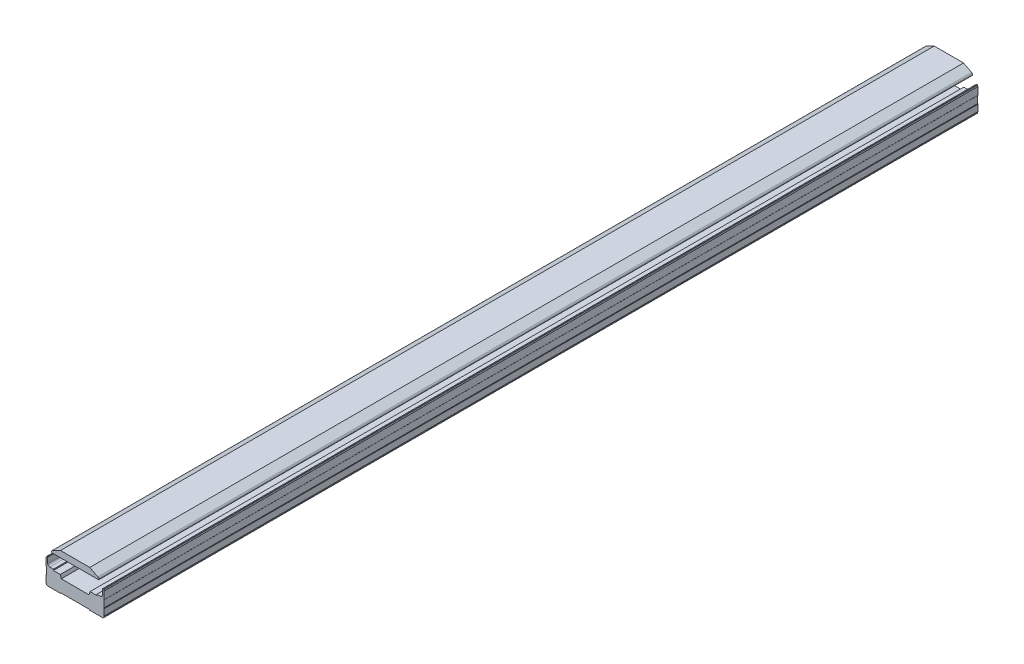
from build123d import *

# Parameters (mm, degrees)
EXTRUDE_1_DEPTH              = 1530
EXTRUDE_1_2_DEPTH            = 1530
HOLE_WIZARD_1_AT_2_COUNT     = 2
HOLE_WIZARD_1_AT_2_PITCH     = 85
HOLE_WIZARD_1_AT_3_COUNT     = 2
HOLE_WIZARD_1_AT_3_PITCH     = 98.615414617
HOLE_WIZARD_1_AT_4_COUNT     = 2
HOLE_WIZARD_1_AT_4_PITCH     = 50
HOLE_WIZARD_1_AT_5_COUNT     = 2
HOLE_WIZARD_1_AT_5_PITCH     = 264.05491853
HOLE_WIZARD_1_AT_6_COUNT     = 2
HOLE_WIZARD_1_AT_6_PITCH     = 250
HOLE_WIZARD_1_AT_7_COUNT     = 2
HOLE_WIZARD_1_AT_7_PITCH     = 457.957421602
HOLE_WIZARD_1_AT_8_COUNT     = 2
HOLE_WIZARD_1_AT_8_PITCH     = 450
HOLE_WIZARD_1_AT_9_COUNT     = 2
HOLE_WIZARD_1_AT_9_PITCH     = 655.53413336
HOLE_WIZARD_1_AT_10_COUNT    = 2
HOLE_WIZARD_1_AT_10_PITCH    = 650
HOLE_WIZARD_1_AT_11_COUNT    = 2
HOLE_WIZARD_1_AT_11_PITCH    = 854.239427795
HOLE_WIZARD_1_AT_12_COUNT    = 2
HOLE_WIZARD_1_AT_12_PITCH    = 850
HOLE_WIZARD_1_AT_13_COUNT    = 2
HOLE_WIZARD_1_AT_13_PITCH    = 1050
HOLE_WIZARD_1_AT_14_COUNT    = 2
HOLE_WIZARD_1_AT_14_PITCH    = 1053.434857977
HOLE_WIZARD_1_AT_15_COUNT    = 2
HOLE_WIZARD_1_AT_15_PITCH    = 1250
HOLE_WIZARD_1_AT_16_COUNT    = 2
HOLE_WIZARD_1_AT_16_PITCH    = 1450
HOLE_WIZARD_1_AT_17_COUNT    = 2
HOLE_WIZARD_1_AT_17_PITCH    = 1452.489242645
HOLE_WIZARD_1_AT_18_COUNT    = 2
HOLE_WIZARD_1_AT_18_PITCH    = 1252.886666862
HOLE_WIZARD_M5_1_AT_2_COUNT  = 2
HOLE_WIZARD_M5_1_AT_2_PITCH  = 85
HOLE_WIZARD_M5_1_AT_3_COUNT  = 2
HOLE_WIZARD_M5_1_AT_3_PITCH  = 50
HOLE_WIZARD_M5_1_AT_4_COUNT  = 2
HOLE_WIZARD_M5_1_AT_4_PITCH  = 98.615414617
HOLE_WIZARD_M5_1_AT_5_COUNT  = 2
HOLE_WIZARD_M5_1_AT_5_PITCH  = 264.05491853
HOLE_WIZARD_M5_1_AT_6_COUNT  = 2
HOLE_WIZARD_M5_1_AT_6_PITCH  = 250
HOLE_WIZARD_M5_1_AT_7_COUNT  = 2
HOLE_WIZARD_M5_1_AT_7_PITCH  = 457.957421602
HOLE_WIZARD_M5_1_AT_8_COUNT  = 2
HOLE_WIZARD_M5_1_AT_8_PITCH  = 450
HOLE_WIZARD_M5_1_AT_9_COUNT  = 2
HOLE_WIZARD_M5_1_AT_9_PITCH  = 655.53413336
HOLE_WIZARD_M5_1_AT_10_COUNT = 2
HOLE_WIZARD_M5_1_AT_10_PITCH = 650
HOLE_WIZARD_M5_1_AT_11_COUNT = 2
HOLE_WIZARD_M5_1_AT_11_PITCH = 854.239427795
HOLE_WIZARD_M5_1_AT_12_COUNT = 2
HOLE_WIZARD_M5_1_AT_12_PITCH = 850
HOLE_WIZARD_M5_1_AT_13_COUNT = 2
HOLE_WIZARD_M5_1_AT_13_PITCH = 1050
HOLE_WIZARD_M5_1_AT_14_COUNT = 2
HOLE_WIZARD_M5_1_AT_14_PITCH = 1053.434857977
HOLE_WIZARD_M5_1_AT_15_COUNT = 2
HOLE_WIZARD_M5_1_AT_15_PITCH = 1250
HOLE_WIZARD_M5_1_AT_16_COUNT = 2
HOLE_WIZARD_M5_1_AT_16_PITCH = 1450
HOLE_WIZARD_M5_1_AT_17_COUNT = 2
HOLE_WIZARD_M5_1_AT_17_PITCH = 1452.489242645
HOLE_WIZARD_M5_1_AT_18_COUNT = 2
HOLE_WIZARD_M5_1_AT_18_PITCH = 1252.886666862


with BuildPart() as part:
    # Sketch 1 → Extrude 1 (new body)
    with BuildSketch(Plane.XY):
        with BuildLine():
            Line((39.861971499, 56.764617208), (25.661733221, 64))
            Line((25.661733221, 64), (24.553334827, 64))
            Line((24.553334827, 64), (-24.553334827, 64))
            Line((-24.553334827, 64), (-25.661733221, 64))
            Line((-25.661733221, 64), (-39.861971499, 56.764617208))
            ThreePointArc((-39.861971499, 56.764617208), (-41.057920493, 55.65909333), (-41.5, 54.091597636))
            Line((-41.5, 54.091597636), (-41.5, 53.4))
            ThreePointArc((-41.5, 53.4), (-41.382842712, 53.117157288), (-41.1, 53))
            Line((-41.1, 53), (41.1, 53))
            ThreePointArc((41.1, 53), (41.382842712, 53.117157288), (41.5, 53.4))
            Line((41.5, 53.4), (41.5, 54.091597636))
            ThreePointArc((41.5, 54.091597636), (41.057920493, 55.65909333), (39.861971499, 56.764617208))
        make_face()
    extrude(amount=-EXTRUDE_1_DEPTH)


with BuildPart() as body_2:
    # Sketch 1 → Extrude 1 2 (new body)
    with BuildSketch(Plane.XY):
        with BuildLine():
            Line((-24.5, 0), (24.5, 0))
            Line((24.5, 0), (25.5, -1))
            Line((25.5, -1), (49, -1))
            ThreePointArc((49, -1), (49.692161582, -0.339351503), (50.141102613, 0.505631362))
            Line((50.141102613, 0.505631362), (50.999993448, 3.000004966))
            Line((50.999993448, 3.000004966), (50.999993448, 14.133979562))
            ThreePointArc((50.999993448, 14.133979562), (50.93300615, 14.383979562), (50.749993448, 14.566992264))
            ThreePointArc((50.749993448, 14.566992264), (50.566980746, 14.750004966), (50.499993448, 15.000004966))
            Line((50.499993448, 15.000004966), (50.499993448, 27.000004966))
            ThreePointArc((50.499993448, 27.000004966), (50.566980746, 27.250004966), (50.749993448, 27.433017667))
            ThreePointArc((50.749993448, 27.433017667), (50.93300615, 27.616030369), (50.999993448, 27.866030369))
            Line((50.999993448, 27.866030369), (50.999993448, 40.881970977))
            ThreePointArc((50.999993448, 40.881970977), (50.988353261, 40.989556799), (50.953817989, 41.09211175))
            Line((50.953817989, 41.09211175), (50.138190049, 42.723611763))
            ThreePointArc((50.138190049, 42.723611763), (49.95384201, 42.92533037), (49.690976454, 43.000004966))
            Line((49.690976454, 43.000004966), (48.299993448, 43.000004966))
            ThreePointArc((48.299993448, 43.000004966), (48.087861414, 42.912137), (47.999993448, 42.700004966))
            Line((47.999993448, 42.700004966), (47.999993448, 33.000004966))
            ThreePointArc((47.999993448, 33.000004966), (46.974867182, 30.525131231), (44.499993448, 29.500004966))
            Line((44.499993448, 29.500004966), (38, 29.500004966))
            Line((38, 29.500004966), (38, 27.5))
            Line((38, 27.5), (26, 27.5))
            Line((26, 27.5), (24.196643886, 21.780485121))
            Line((24.196643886, 21.780485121), (-24.196643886, 21.780485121))
            Line((-24.196643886, 21.780485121), (-26, 27.5))
            Line((-26, 27.5), (-38, 27.5))
            Line((-38, 27.5), (-38, 29.5))
            Line((-38, 29.5), (-44.5, 29.5))
            ThreePointArc((-44.5, 29.5), (-46.974873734, 30.525126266), (-48, 33))
            Line((-48, 33), (-48, 42.7))
            ThreePointArc((-48, 42.7), (-48.087867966, 42.912132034), (-48.3, 43))
            Line((-48.3, 43), (-49.690983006, 43))
            ThreePointArc((-49.690983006, 43), (-49.953848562, 42.925325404), (-50.138196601, 42.723606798))
            Line((-50.138196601, 42.723606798), (-50.953824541, 41.092106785))
            ThreePointArc((-50.953824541, 41.092106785), (-50.988359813, 40.989551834), (-51, 40.881966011))
            Line((-51, 40.881966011), (-51, 27.866025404))
            ThreePointArc((-51, 27.866025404), (-50.933012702, 27.616025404), (-50.75, 27.433012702))
            ThreePointArc((-50.75, 27.433012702), (-50.566987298, 27.25), (-50.5, 27))
            Line((-50.5, 27), (-50.5, 15))
            ThreePointArc((-50.5, 15), (-50.566987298, 14.75), (-50.75, 14.566987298))
            ThreePointArc((-50.75, 14.566987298), (-50.933012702, 14.383974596), (-51, 14.133974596))
            Line((-51, 14.133974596), (-51, 3))
            Line((-51, 3), (-50.141114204, 0.505614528))
            ThreePointArc((-50.141114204, 0.505614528), (-49.692165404, -0.339360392), (-49, -1))
            Line((-49, -1), (-25.5, -1))
            Line((-25.5, -1), (-24.5, 0))
        make_face()
    extrude(amount=-EXTRUDE_1_2_DEPTH)

    # Sketch 4 → Hole Wizard 1 (revolve, cut)
    with BuildSketch(Plane(origin=(-42.5, 43, -1479.5), x_dir=(0, 0, 1), z_dir=(1, 0, 0))):
        Polygon((0, 0), (0, 44), (2.75, 44), (2.75, 30.5), (5, 30.5), (5, 0), align=None)
    hole_wizard_1 = revolve(axis=Axis((-42.5, 49.35, -1479.5), (0, -1, 0)), mode=Mode.SUBTRACT)

    # Hole Wizard 1 at 2: Hole Wizard 1 ×2
    with Locations(*[(i * HOLE_WIZARD_1_AT_2_PITCH, 0, 0) for i in range(1, HOLE_WIZARD_1_AT_2_COUNT)]):
        add(hole_wizard_1, mode=Mode.SUBTRACT)

    # Hole Wizard 1 at 3: Hole Wizard 1 ×2
    with Locations(*[Vector(0.8619342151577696, 0, 0.5070201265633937) * (i * HOLE_WIZARD_1_AT_3_PITCH) for i in range(1, HOLE_WIZARD_1_AT_3_COUNT)]):
        add(hole_wizard_1, mode=Mode.SUBTRACT)

    # Hole Wizard 1 at 4: Hole Wizard 1 ×2
    with Locations(*[(0, 0, i * HOLE_WIZARD_1_AT_4_PITCH) for i in range(1, HOLE_WIZARD_1_AT_4_COUNT)]):
        add(hole_wizard_1, mode=Mode.SUBTRACT)

    # Hole Wizard 1 at 5: Hole Wizard 1 ×2
    with Locations(*[Vector(0.32190273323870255, 0, 0.9467727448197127) * (i * HOLE_WIZARD_1_AT_5_PITCH) for i in range(1, HOLE_WIZARD_1_AT_5_COUNT)]):
        add(hole_wizard_1, mode=Mode.SUBTRACT)

    # Hole Wizard 1 at 6: Hole Wizard 1 ×2
    with Locations(*[(0, 0, i * HOLE_WIZARD_1_AT_6_PITCH) for i in range(1, HOLE_WIZARD_1_AT_6_COUNT)]):
        add(hole_wizard_1, mode=Mode.SUBTRACT)

    # Hole Wizard 1 at 7: Hole Wizard 1 ×2
    with Locations(*[Vector(0.18560677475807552, 0, 0.9826241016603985) * (i * HOLE_WIZARD_1_AT_7_PITCH) for i in range(1, HOLE_WIZARD_1_AT_7_COUNT)]):
        add(hole_wizard_1, mode=Mode.SUBTRACT)

    # Hole Wizard 1 at 8: Hole Wizard 1 ×2
    with Locations(*[(0, 0, i * HOLE_WIZARD_1_AT_8_PITCH) for i in range(1, HOLE_WIZARD_1_AT_8_COUNT)]):
        add(hole_wizard_1, mode=Mode.SUBTRACT)

    # Hole Wizard 1 at 9: Hole Wizard 1 ×2
    with Locations(*[Vector(0.12966525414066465, 0, 0.9915578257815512) * (i * HOLE_WIZARD_1_AT_9_PITCH) for i in range(1, HOLE_WIZARD_1_AT_9_COUNT)]):
        add(hole_wizard_1, mode=Mode.SUBTRACT)

    # Hole Wizard 1 at 10: Hole Wizard 1 ×2
    with Locations(*[(0, 0, i * HOLE_WIZARD_1_AT_10_PITCH) for i in range(1, HOLE_WIZARD_1_AT_10_COUNT)]):
        add(hole_wizard_1, mode=Mode.SUBTRACT)

    # Hole Wizard 1 at 11: Hole Wizard 1 ×2
    with Locations(*[Vector(0.09950371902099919, 0, 0.9950371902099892) * (i * HOLE_WIZARD_1_AT_11_PITCH) for i in range(1, HOLE_WIZARD_1_AT_11_COUNT)]):
        add(hole_wizard_1, mode=Mode.SUBTRACT)

    # Hole Wizard 1 at 12: Hole Wizard 1 ×2
    with Locations(*[(0, 0, i * HOLE_WIZARD_1_AT_12_PITCH) for i in range(1, HOLE_WIZARD_1_AT_12_COUNT)]):
        add(hole_wizard_1, mode=Mode.SUBTRACT)

    # Hole Wizard 1 at 13: Hole Wizard 1 ×2
    with Locations(*[(0, 0, i * HOLE_WIZARD_1_AT_13_PITCH) for i in range(1, HOLE_WIZARD_1_AT_13_COUNT)]):
        add(hole_wizard_1, mode=Mode.SUBTRACT)

    # Hole Wizard 1 at 14: Hole Wizard 1 ×2
    with Locations(*[Vector(0.08068842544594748, 0, 0.9967393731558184) * (i * HOLE_WIZARD_1_AT_14_PITCH) for i in range(1, HOLE_WIZARD_1_AT_14_COUNT)]):
        add(hole_wizard_1, mode=Mode.SUBTRACT)

    # Hole Wizard 1 at 15: Hole Wizard 1 ×2
    with Locations(*[(0, 0, i * HOLE_WIZARD_1_AT_15_PITCH) for i in range(1, HOLE_WIZARD_1_AT_15_COUNT)]):
        add(hole_wizard_1, mode=Mode.SUBTRACT)

    # Hole Wizard 1 at 16: Hole Wizard 1 ×2
    with Locations(*[(0, 0, i * HOLE_WIZARD_1_AT_16_PITCH) for i in range(1, HOLE_WIZARD_1_AT_16_COUNT)]):
        add(hole_wizard_1, mode=Mode.SUBTRACT)

    # Hole Wizard 1 at 17: Hole Wizard 1 ×2
    with Locations(*[Vector(0.05852022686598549, 0, 0.9982862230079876) * (i * HOLE_WIZARD_1_AT_17_PITCH) for i in range(1, HOLE_WIZARD_1_AT_17_COUNT)]):
        add(hole_wizard_1, mode=Mode.SUBTRACT)

    # Hole Wizard 1 at 18: Hole Wizard 1 ×2
    with Locations(*[Vector(0.06784332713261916, 0, 0.9976959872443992) * (i * HOLE_WIZARD_1_AT_18_PITCH) for i in range(1, HOLE_WIZARD_1_AT_18_COUNT)]):
        add(hole_wizard_1, mode=Mode.SUBTRACT)

    # Sketch 6 → Hole Wizard M5 _1 (revolve, cut)
    with BuildSketch(Plane(origin=(-42.5, -1, -1489.5), x_dir=(0, 0, -1), z_dir=(1, 0, 0))):
        Polygon((0, 0), (0, 13.6618073), (2.1, 12.4), (2.1, 0), align=None)
    hole_wizard_m5_1 = revolve(axis=Axis((-42.5, -7.35, -1489.5), (0, 1, 0)), mode=Mode.SUBTRACT)

    # Hole Wizard M5 _1 at 2: Hole Wizard M5 _1 ×2
    with Locations(*[(i * HOLE_WIZARD_M5_1_AT_2_PITCH, 0, 0) for i in range(1, HOLE_WIZARD_M5_1_AT_2_COUNT)]):
        add(hole_wizard_m5_1, mode=Mode.SUBTRACT)

    # Hole Wizard M5 _1 at 3: Hole Wizard M5 _1 ×2
    with Locations(*[(0, 0, i * HOLE_WIZARD_M5_1_AT_3_PITCH) for i in range(1, HOLE_WIZARD_M5_1_AT_3_COUNT)]):
        add(hole_wizard_m5_1, mode=Mode.SUBTRACT)

    # Hole Wizard M5 _1 at 4: Hole Wizard M5 _1 ×2
    with Locations(*[Vector(0.8619342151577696, 0, 0.5070201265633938) * (i * HOLE_WIZARD_M5_1_AT_4_PITCH) for i in range(1, HOLE_WIZARD_M5_1_AT_4_COUNT)]):
        add(hole_wizard_m5_1, mode=Mode.SUBTRACT)

    # Hole Wizard M5 _1 at 5: Hole Wizard M5 _1 ×2
    with Locations(*[Vector(0.3219027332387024, 0, 0.9467727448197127) * (i * HOLE_WIZARD_M5_1_AT_5_PITCH) for i in range(1, HOLE_WIZARD_M5_1_AT_5_COUNT)]):
        add(hole_wizard_m5_1, mode=Mode.SUBTRACT)

    # Hole Wizard M5 _1 at 6: Hole Wizard M5 _1 ×2
    with Locations(*[(0, 0, i * HOLE_WIZARD_M5_1_AT_6_PITCH) for i in range(1, HOLE_WIZARD_M5_1_AT_6_COUNT)]):
        add(hole_wizard_m5_1, mode=Mode.SUBTRACT)

    # Hole Wizard M5 _1 at 7: Hole Wizard M5 _1 ×2
    with Locations(*[Vector(0.18560677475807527, 0, 0.9826241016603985) * (i * HOLE_WIZARD_M5_1_AT_7_PITCH) for i in range(1, HOLE_WIZARD_M5_1_AT_7_COUNT)]):
        add(hole_wizard_m5_1, mode=Mode.SUBTRACT)

    # Hole Wizard M5 _1 at 8: Hole Wizard M5 _1 ×2
    with Locations(*[(0, 0, i * HOLE_WIZARD_M5_1_AT_8_PITCH) for i in range(1, HOLE_WIZARD_M5_1_AT_8_COUNT)]):
        add(hole_wizard_m5_1, mode=Mode.SUBTRACT)

    # Hole Wizard M5 _1 at 9: Hole Wizard M5 _1 ×2
    with Locations(*[Vector(0.1296652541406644, 0, 0.9915578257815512) * (i * HOLE_WIZARD_M5_1_AT_9_PITCH) for i in range(1, HOLE_WIZARD_M5_1_AT_9_COUNT)]):
        add(hole_wizard_m5_1, mode=Mode.SUBTRACT)

    # Hole Wizard M5 _1 at 10: Hole Wizard M5 _1 ×2
    with Locations(*[(0, 0, i * HOLE_WIZARD_M5_1_AT_10_PITCH) for i in range(1, HOLE_WIZARD_M5_1_AT_10_COUNT)]):
        add(hole_wizard_m5_1, mode=Mode.SUBTRACT)

    # Hole Wizard M5 _1 at 11: Hole Wizard M5 _1 ×2
    with Locations(*[Vector(0.09950371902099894, 0, 0.9950371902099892) * (i * HOLE_WIZARD_M5_1_AT_11_PITCH) for i in range(1, HOLE_WIZARD_M5_1_AT_11_COUNT)]):
        add(hole_wizard_m5_1, mode=Mode.SUBTRACT)

    # Hole Wizard M5 _1 at 12: Hole Wizard M5 _1 ×2
    with Locations(*[(0, 0, i * HOLE_WIZARD_M5_1_AT_12_PITCH) for i in range(1, HOLE_WIZARD_M5_1_AT_12_COUNT)]):
        add(hole_wizard_m5_1, mode=Mode.SUBTRACT)

    # Hole Wizard M5 _1 at 13: Hole Wizard M5 _1 ×2
    with Locations(*[(0, 0, i * HOLE_WIZARD_M5_1_AT_13_PITCH) for i in range(1, HOLE_WIZARD_M5_1_AT_13_COUNT)]):
        add(hole_wizard_m5_1, mode=Mode.SUBTRACT)

    # Hole Wizard M5 _1 at 14: Hole Wizard M5 _1 ×2
    with Locations(*[Vector(0.08068842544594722, 0, 0.9967393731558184) * (i * HOLE_WIZARD_M5_1_AT_14_PITCH) for i in range(1, HOLE_WIZARD_M5_1_AT_14_COUNT)]):
        add(hole_wizard_m5_1, mode=Mode.SUBTRACT)

    # Hole Wizard M5 _1 at 15: Hole Wizard M5 _1 ×2
    with Locations(*[(0, 0, i * HOLE_WIZARD_M5_1_AT_15_PITCH) for i in range(1, HOLE_WIZARD_M5_1_AT_15_COUNT)]):
        add(hole_wizard_m5_1, mode=Mode.SUBTRACT)

    # Hole Wizard M5 _1 at 16: Hole Wizard M5 _1 ×2
    with Locations(*[(0, 0, i * HOLE_WIZARD_M5_1_AT_16_PITCH) for i in range(1, HOLE_WIZARD_M5_1_AT_16_COUNT)]):
        add(hole_wizard_m5_1, mode=Mode.SUBTRACT)

    # Hole Wizard M5 _1 at 17: Hole Wizard M5 _1 ×2
    with Locations(*[Vector(0.05852022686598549, 0, 0.9982862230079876) * (i * HOLE_WIZARD_M5_1_AT_17_PITCH) for i in range(1, HOLE_WIZARD_M5_1_AT_17_COUNT)]):
        add(hole_wizard_m5_1, mode=Mode.SUBTRACT)

    # Hole Wizard M5 _1 at 18: Hole Wizard M5 _1 ×2
    with Locations(*[Vector(0.06784332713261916, 0, 0.9976959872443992) * (i * HOLE_WIZARD_M5_1_AT_18_PITCH) for i in range(1, HOLE_WIZARD_M5_1_AT_18_COUNT)]):
        add(hole_wizard_m5_1, mode=Mode.SUBTRACT)


solid = Compound([part.part, body_2.part])
